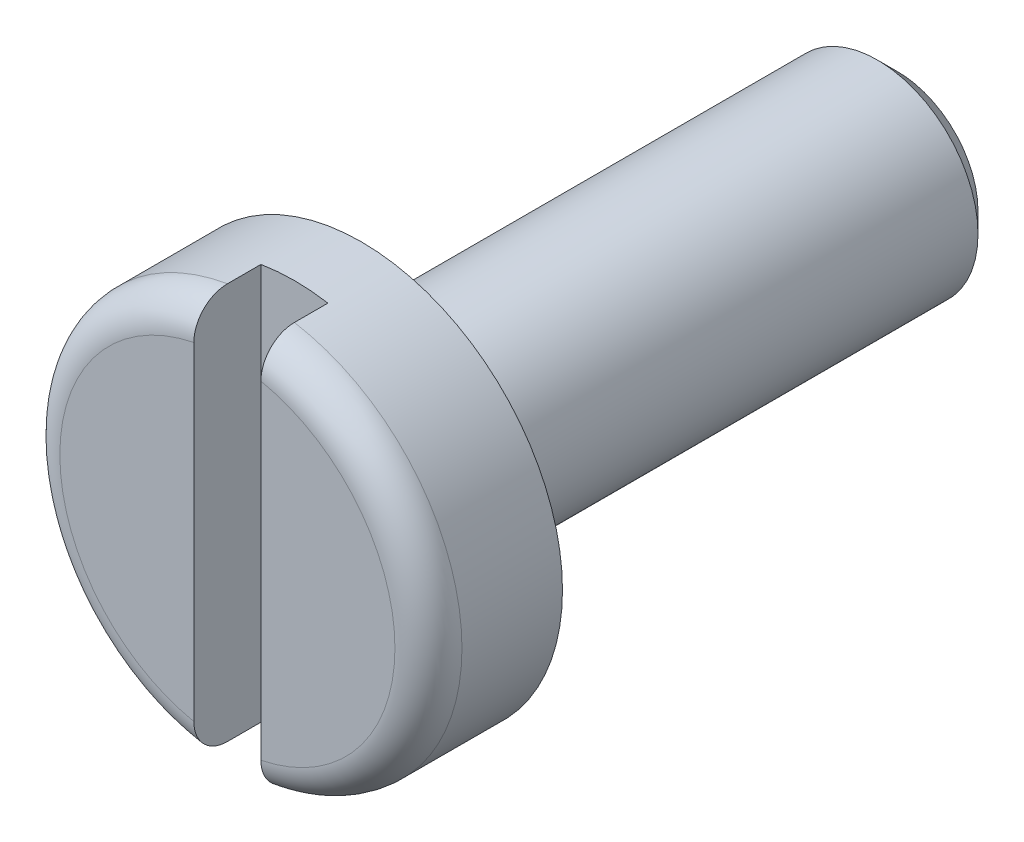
ISO-10303-21;
HEADER;
FILE_DESCRIPTION(('STEP AP214'),'2;1');
FILE_NAME('part.step','',(''),(''),'','','');
FILE_SCHEMA(('AUTOMOTIVE_DESIGN { 1 0 10303 214 1 1 1 1 }'));
ENDSEC;
DATA;
#1=APPLICATION_CONTEXT('core data for automotive mechanical design processes');
#2=APPLICATION_PROTOCOL_DEFINITION('international standard','automotive_design',2000,#1);
#3=PRODUCT_CONTEXT('',#1,'mechanical');
#4=PRODUCT('Part','Part','',(#3));
#5=PRODUCT_RELATED_PRODUCT_CATEGORY('part','',(#4));
#6=PRODUCT_DEFINITION_FORMATION('','',#4);
#7=PRODUCT_DEFINITION_CONTEXT('part definition',#1,'design');
#8=PRODUCT_DEFINITION('design','',#6,#7);
#9=PRODUCT_DEFINITION_SHAPE('','',#8);
#10=(LENGTH_UNIT() NAMED_UNIT(*) SI_UNIT(.MILLI.,.METRE.));
#11=(NAMED_UNIT(*) PLANE_ANGLE_UNIT() SI_UNIT($,.RADIAN.));
#12=(NAMED_UNIT(*) SI_UNIT($,.STERADIAN.) SOLID_ANGLE_UNIT());
#13=UNCERTAINTY_MEASURE_WITH_UNIT(LENGTH_MEASURE(1.E-05),#10,'distance_accuracy_value','');
#14=(GEOMETRIC_REPRESENTATION_CONTEXT(3) GLOBAL_UNCERTAINTY_ASSIGNED_CONTEXT((#13)) GLOBAL_UNIT_ASSIGNED_CONTEXT((#10,
#11,#12)) REPRESENTATION_CONTEXT('',''));
#15=CARTESIAN_POINT('',(0.,0.,0.));
#16=DIRECTION('',(0.,0.,1.));
#17=DIRECTION('',(1.,0.,0.));
#18=AXIS2_PLACEMENT_3D('',#15,#16,#17);
#19=CARTESIAN_POINT('',(0.,0.,10.));
#20=DIRECTION('',(0.,0.,1.));
#21=DIRECTION('',(1.,0.,0.));
#22=AXIS2_PLACEMENT_3D('',#19,#20,#21);
#23=PLANE('',#22);
#24=DIRECTION('',(0.,-1.,0.));
#25=VECTOR('',#24,1.);
#26=CARTESIAN_POINT('',(-0.5,3.22863713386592,10.));
#27=LINE('',#26,#25);
#28=CARTESIAN_POINT('',(-0.5,2.44948974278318,10.));
#29=VERTEX_POINT('',#28);
#30=CARTESIAN_POINT('',(-0.5,-2.44948974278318,10.));
#31=VERTEX_POINT('',#30);
#32=EDGE_CURVE('E100',#29,#31,#27,.T.);
#33=ORIENTED_EDGE('',*,*,#32,.F.);
#34=CARTESIAN_POINT('',(0.,0.,10.));
#35=DIRECTION('',(0.,0.,1.));
#36=DIRECTION('',(1.,0.,0.));
#37=AXIS2_PLACEMENT_3D('',#34,#35,#36);
#38=CIRCLE('',#37,2.5);
#39=EDGE_CURVE('E112',#29,#31,#38,.T.);
#40=ORIENTED_EDGE('',*,*,#39,.T.);
#41=EDGE_LOOP('',(#33,#40));
#42=FACE_BOUND('',#41,.T.);
#43=ADVANCED_FACE('F45',(#42),#23,.T.);
#44=CARTESIAN_POINT('',(0.,0.,9.5));
#45=DIRECTION('',(0.,0.,1.));
#46=DIRECTION('',(1.,0.,0.));
#47=AXIS2_PLACEMENT_3D('',#44,#45,#46);
#48=TOROIDAL_SURFACE('',#47,2.5,0.5);
#49=CARTESIAN_POINT('',(-0.5,-2.95035211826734,9.58673244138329));
#50=CARTESIAN_POINT('',(-0.5,-2.9552262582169,9.55944159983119));
#51=CARTESIAN_POINT('',(-0.5,-2.95779886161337,9.53171948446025));
#52=CARTESIAN_POINT('',(-0.5,-2.9582489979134,9.47621500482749));
#53=CARTESIAN_POINT('',(-0.5,-2.95612106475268,9.44843260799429));
#54=CARTESIAN_POINT('',(-0.5,-2.94723003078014,9.39363370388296));
#55=CARTESIAN_POINT('',(-0.5,-2.94046955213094,9.36661677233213));
#56=CARTESIAN_POINT('',(-0.5,-2.92252194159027,9.31410440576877));
#57=CARTESIAN_POINT('',(-0.5,-2.91133582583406,9.28860862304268));
#58=CARTESIAN_POINT('',(-0.5,-2.88483470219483,9.23977125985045));
#59=CARTESIAN_POINT('',(-0.5,-2.86950835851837,9.21643583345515));
#60=CARTESIAN_POINT('',(-0.5,-2.83519284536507,9.17263473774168));
#61=CARTESIAN_POINT('',(-0.5,-2.81620340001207,9.15216928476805));
#62=CARTESIAN_POINT('',(-0.5,-2.77489524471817,9.11445400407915));
#63=CARTESIAN_POINT('',(-0.5,-2.75254376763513,9.09724007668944));
#64=CARTESIAN_POINT('',(-0.5,-2.70530445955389,9.06674270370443));
#65=CARTESIAN_POINT('',(-0.5,-2.68041644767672,9.05345953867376));
#66=CARTESIAN_POINT('',(-0.5,-2.62840350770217,9.0309805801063));
#67=CARTESIAN_POINT('',(-0.5,-2.60125007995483,9.02185074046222));
#68=CARTESIAN_POINT('',(-0.5,-2.54580904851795,9.00819871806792));
#69=CARTESIAN_POINT('',(-0.5,-2.51752134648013,9.00367693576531));
#70=CARTESIAN_POINT('',(-0.5,-2.46012662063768,8.99929986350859));
#71=CARTESIAN_POINT('',(-0.5,-2.4310137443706,8.99952119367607));
#72=CARTESIAN_POINT('',(-0.5,-2.37322772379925,9.00479285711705));
#73=CARTESIAN_POINT('',(-0.5,-2.34455461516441,9.00984358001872));
#74=CARTESIAN_POINT('',(-0.5,-2.28814273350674,9.02471030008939));
#75=CARTESIAN_POINT('',(-0.5,-2.26041717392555,9.0345765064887));
#76=CARTESIAN_POINT('',(-0.5,-2.20701871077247,9.05883277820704));
#77=CARTESIAN_POINT('',(-0.5,-2.18134585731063,9.07322295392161));
#78=CARTESIAN_POINT('',(-0.5,-2.13286586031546,9.10611125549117));
#79=CARTESIAN_POINT('',(-0.5,-2.11005221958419,9.12459979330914));
#80=CARTESIAN_POINT('',(-0.5,-2.06792695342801,9.1652124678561));
#81=CARTESIAN_POINT('',(-0.5,-2.04861500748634,9.1873362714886));
#82=CARTESIAN_POINT('',(-0.5,-2.01446117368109,9.23415097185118));
#83=CARTESIAN_POINT('',(-0.5,-1.9995404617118,9.25878431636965));
#84=CARTESIAN_POINT('',(-0.5,-1.97419007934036,9.31026302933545));
#85=CARTESIAN_POINT('',(-0.5,-1.96375954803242,9.33710797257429));
#86=CARTESIAN_POINT('',(-0.5,-1.94799923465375,9.39141122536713));
#87=CARTESIAN_POINT('',(-0.5,-1.94253032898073,9.41882918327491));
#88=CARTESIAN_POINT('',(-0.5,-1.93637923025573,9.47419566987));
#89=CARTESIAN_POINT('',(-0.5,-1.93569635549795,9.50214412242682));
#90=CARTESIAN_POINT('',(-0.5,-1.93910574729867,9.55717926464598));
#91=CARTESIAN_POINT('',(-0.5,-1.94310200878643,9.58427196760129));
#92=CARTESIAN_POINT('',(-0.5,-1.95557178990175,9.63740480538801));
#93=CARTESIAN_POINT('',(-0.5,-1.96404530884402,9.66344494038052));
#94=CARTESIAN_POINT('',(-0.5,-1.98522261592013,9.71385005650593));
#95=CARTESIAN_POINT('',(-0.5,-1.9979413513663,9.73820874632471));
#96=CARTESIAN_POINT('',(-0.5,-2.02719570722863,9.78451298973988));
#97=CARTESIAN_POINT('',(-0.5,-2.04373174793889,9.80645827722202));
#98=CARTESIAN_POINT('',(-0.5,-2.08056612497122,9.84788184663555));
#99=CARTESIAN_POINT('',(-0.5,-2.10094523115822,9.86728828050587));
#100=CARTESIAN_POINT('',(-0.5,-2.14459530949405,9.90251725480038));
#101=CARTESIAN_POINT('',(-0.5,-2.1678666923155,9.91833928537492));
#102=CARTESIAN_POINT('',(-0.5,-2.21733710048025,9.94640011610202));
#103=CARTESIAN_POINT('',(-0.5,-2.24359938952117,9.95852745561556));
#104=CARTESIAN_POINT('',(-0.5,-2.2977657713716,9.97828239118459));
#105=CARTESIAN_POINT('',(-0.5,-2.32567003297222,9.9859095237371));
#106=CARTESIAN_POINT('',(-0.5,-2.38281564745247,9.99654662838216));
#107=CARTESIAN_POINT('',(-0.5,-2.41207134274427,9.99947974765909));
#108=CARTESIAN_POINT('',(-0.5,-2.47066120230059,10.0003935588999));
#109=CARTESIAN_POINT('',(-0.5,-2.49999536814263,9.99837415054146));
#110=CARTESIAN_POINT('',(-0.5,-2.55790116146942,9.98941380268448));
#111=CARTESIAN_POINT('',(-0.5,-2.58647286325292,9.98247334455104));
#112=CARTESIAN_POINT('',(-0.5,-2.64202024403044,9.96383545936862));
#113=CARTESIAN_POINT('',(-0.5,-2.66899607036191,9.9521384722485));
#114=CARTESIAN_POINT('',(-0.5,-2.72022813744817,9.92446321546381));
#115=CARTESIAN_POINT('',(-0.5,-2.744513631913,9.90853911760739));
#116=CARTESIAN_POINT('',(-0.5,-2.79001381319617,9.87277033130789));
#117=CARTESIAN_POINT('',(-0.5,-2.81122799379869,9.85292499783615));
#118=CARTESIAN_POINT('',(-0.5,-2.8496084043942,9.81022796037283));
#119=CARTESIAN_POINT('',(-0.5,-2.86683447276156,9.78742998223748));
#120=CARTESIAN_POINT('',(-0.5,-2.89712793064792,9.7392475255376));
#121=CARTESIAN_POINT('',(-0.5,-2.91020078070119,9.71386650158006));
#122=CARTESIAN_POINT('',(-0.5,-2.92766179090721,9.67134620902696));
#123=CARTESIAN_POINT('',(-0.5,-2.93345883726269,9.65477098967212));
#124=CARTESIAN_POINT('',(-0.5,-2.94326182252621,9.62109888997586));
#125=CARTESIAN_POINT('',(-0.5,-2.9472677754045,9.6040020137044));
#126=CARTESIAN_POINT('',(-0.5,-2.95035211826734,9.58673244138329));
#127=B_SPLINE_CURVE_WITH_KNOTS('',3,(#49,#50,#51,#52,#53,#54,#55,#56,#57,#58,#59,#60,#61,#62,
#63,#64,#65,#66,#67,#68,#69,#70,#71,#72,#73,#74,#75,#76,#77,#78,#79,#80,#81,#82,#83,#84,#85,#86,
#87,#88,#89,#90,#91,#92,#93,#94,#95,#96,#97,#98,#99,#100,#101,#102,#103,#104,#105,#106,#107,
#108,#109,#110,#111,#112,#113,#114,#115,#116,#117,#118,#119,#120,#121,#122,#123,#124,#125,#126),
.UNSPECIFIED.,.T.,.F.,(4,2,2,2,2,2,2,2,2,2,2,2,2,2,2,2,2,2,2,2,2,2,2,2,2,2,2,2,2,2,2,2,2,2,2,2,
2,2,4),(0.,0.0831039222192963,0.166304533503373,0.249458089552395,0.3325925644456,
0.415957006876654,0.499327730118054,0.583571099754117,0.667820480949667,0.753364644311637,
0.838916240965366,0.925850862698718,1.01279249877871,1.10066065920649,1.18853096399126,
1.27619782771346,1.36385666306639,1.44982967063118,1.53578618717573,1.61925046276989,
1.70270284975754,1.78447255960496,1.86624225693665,1.94830295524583,2.03037269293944,
2.11441209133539,2.19846343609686,2.2848442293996,2.37123391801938,2.4590240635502,
2.54681598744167,2.63459932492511,2.72237454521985,2.80907507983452,2.89578988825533,
2.98110432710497,3.06630612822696,3.11889448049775,3.1714824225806),.UNSPECIFIED.);
#128=CARTESIAN_POINT('',(-0.5,-2.95803989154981,9.5));
#129=VERTEX_POINT('',#128);
#130=EDGE_CURVE('E69',#31,#129,#127,.T.);
#131=ORIENTED_EDGE('',*,*,#130,.F.);
#132=ORIENTED_EDGE('',*,*,#39,.F.);
#133=CARTESIAN_POINT('',(-0.5,1.94578845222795,9.59445559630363));
#134=CARTESIAN_POINT('',(-0.5,1.94047373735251,9.56769133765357));
#135=CARTESIAN_POINT('',(-0.5,1.93741427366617,9.54046015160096));
#136=CARTESIAN_POINT('',(-0.5,1.93592664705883,9.4858519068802));
#137=CARTESIAN_POINT('',(-0.5,1.93750333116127,9.4584747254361));
#138=CARTESIAN_POINT('',(-0.5,1.94523620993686,9.40439385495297));
#139=CARTESIAN_POINT('',(-0.5,1.95138916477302,9.37768970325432));
#140=CARTESIAN_POINT('',(-0.5,1.96805796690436,9.32568825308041));
#141=CARTESIAN_POINT('',(-0.5,1.97857312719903,9.30039073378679));
#142=CARTESIAN_POINT('',(-0.5,2.00371458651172,9.25169307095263));
#143=CARTESIAN_POINT('',(-0.5,2.01837080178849,9.2283083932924));
#144=CARTESIAN_POINT('',(-0.5,2.05130528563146,9.18424726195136));
#145=CARTESIAN_POINT('',(-0.5,2.06958408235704,9.16357120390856));
#146=CARTESIAN_POINT('',(-0.5,2.1097606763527,9.12492661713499));
#147=CARTESIAN_POINT('',(-0.5,2.13174179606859,9.10704472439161));
#148=CARTESIAN_POINT('',(-0.5,2.1783299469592,9.07511229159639));
#149=CARTESIAN_POINT('',(-0.5,2.20293734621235,9.0610622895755));
#150=CARTESIAN_POINT('',(-0.5,2.25477190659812,9.03682556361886));
#151=CARTESIAN_POINT('',(-0.5,2.28205058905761,9.02674892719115));
#152=CARTESIAN_POINT('',(-0.5,2.3379011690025,9.01125429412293));
#153=CARTESIAN_POINT('',(-0.5,2.36647317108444,9.00583667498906));
#154=CARTESIAN_POINT('',(-0.5,2.42447780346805,8.99977564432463));
#155=CARTESIAN_POINT('',(-0.5,2.45391670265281,8.99919195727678));
#156=CARTESIAN_POINT('',(-0.5,2.51247328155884,9.00299281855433));
#157=CARTESIAN_POINT('',(-0.5,2.54159096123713,9.00737736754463));
#158=CARTESIAN_POINT('',(-0.5,2.59856027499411,9.02099630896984));
#159=CARTESIAN_POINT('',(-0.5,2.6264160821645,9.03021321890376));
#160=CARTESIAN_POINT('',(-0.5,2.6801515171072,9.05325789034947));
#161=CARTESIAN_POINT('',(-0.5,2.70603127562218,9.0670853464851));
#162=CARTESIAN_POINT('',(-0.5,2.75469065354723,9.09875942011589));
#163=CARTESIAN_POINT('',(-0.5,2.77750835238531,9.11654752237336));
#164=CARTESIAN_POINT('',(-0.5,2.8197692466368,9.15576145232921));
#165=CARTESIAN_POINT('',(-0.5,2.83921274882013,9.17718694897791));
#166=CARTESIAN_POINT('',(-0.5,2.87383046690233,9.2226821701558));
#167=CARTESIAN_POINT('',(-0.5,2.8890704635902,9.24670184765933));
#168=CARTESIAN_POINT('',(-0.5,2.91523641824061,9.29698624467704));
#169=CARTESIAN_POINT('',(-0.5,2.9261627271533,9.32325078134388));
#170=CARTESIAN_POINT('',(-0.5,2.94324351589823,9.37689257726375));
#171=CARTESIAN_POINT('',(-0.5,2.94946107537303,9.40424976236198));
#172=CARTESIAN_POINT('',(-0.5,2.95717759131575,9.45962138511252));
#173=CARTESIAN_POINT('',(-0.5,2.95867678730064,9.48763578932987));
#174=CARTESIAN_POINT('',(-0.5,2.95691729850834,9.54330961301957));
#175=CARTESIAN_POINT('',(-0.5,2.9536931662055,9.57097013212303));
#176=CARTESIAN_POINT('',(-0.5,2.94264811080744,9.62535688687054));
#177=CARTESIAN_POINT('',(-0.5,2.93482724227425,9.65208313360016));
#178=CARTESIAN_POINT('',(-0.5,2.91482050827,9.70386040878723));
#179=CARTESIAN_POINT('',(-0.5,2.90263280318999,9.7289107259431));
#180=CARTESIAN_POINT('',(-0.5,2.87425638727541,9.77663106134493));
#181=CARTESIAN_POINT('',(-0.5,2.85806756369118,9.79930101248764));
#182=CARTESIAN_POINT('',(-0.5,2.82201972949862,9.84181694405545));
#183=CARTESIAN_POINT('',(-0.5,2.80213259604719,9.86163907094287));
#184=CARTESIAN_POINT('',(-0.5,2.75935276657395,9.89771791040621));
#185=CARTESIAN_POINT('',(-0.5,2.73645988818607,9.91397440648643));
#186=CARTESIAN_POINT('',(-0.5,2.68798257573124,9.94270597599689));
#187=CARTESIAN_POINT('',(-0.5,2.66236522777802,9.9551255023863));
#188=CARTESIAN_POINT('',(-0.5,2.6094327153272,9.97556637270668));
#189=CARTESIAN_POINT('',(-0.5,2.58211740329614,9.98358733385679));
#190=CARTESIAN_POINT('',(-0.5,2.52608361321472,9.99514067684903));
#191=CARTESIAN_POINT('',(-0.5,2.49734942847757,9.99859689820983));
#192=CARTESIAN_POINT('',(-0.5,2.43970498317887,10.0007067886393));
#193=CARTESIAN_POINT('',(-0.5,2.41079470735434,9.99936003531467));
#194=CARTESIAN_POINT('',(-0.5,2.3532003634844,9.9918654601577));
#195=CARTESIAN_POINT('',(-0.5,2.32452477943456,9.98565230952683));
#196=CARTESIAN_POINT('',(-0.5,2.26861556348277,9.96851868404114));
#197=CARTESIAN_POINT('',(-0.5,2.24138195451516,9.95759813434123));
#198=CARTESIAN_POINT('',(-0.5,2.18904591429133,9.93129320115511));
#199=CARTESIAN_POINT('',(-0.5,2.16395095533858,9.91589393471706));
#200=CARTESIAN_POINT('',(-0.5,2.11673735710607,9.88104524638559));
#201=CARTESIAN_POINT('',(-0.5,2.09461934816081,9.8615949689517));
#202=CARTESIAN_POINT('',(-0.5,2.05431518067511,9.8194369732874));
#203=CARTESIAN_POINT('',(-0.5,2.03608387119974,9.79677241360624));
#204=CARTESIAN_POINT('',(-0.5,2.00383030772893,9.74865099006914));
#205=CARTESIAN_POINT('',(-0.5,1.98980208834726,9.72319815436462));
#206=CARTESIAN_POINT('',(-0.5,1.97088028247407,9.68034156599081));
#207=CARTESIAN_POINT('',(-0.5,1.96454207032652,9.66356088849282));
#208=CARTESIAN_POINT('',(-0.5,1.95374122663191,9.62940578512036));
#209=CARTESIAN_POINT('',(-0.5,1.94927856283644,9.61203136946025));
#210=CARTESIAN_POINT('',(-0.5,1.94578845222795,9.59445559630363));
#211=B_SPLINE_CURVE_WITH_KNOTS('',3,(#133,#134,#135,#136,#137,#138,#139,#140,#141,#142,#143,
#144,#145,#146,#147,#148,#149,#150,#151,#152,#153,#154,#155,#156,#157,#158,#159,#160,#161,#162,
#163,#164,#165,#166,#167,#168,#169,#170,#171,#172,#173,#174,#175,#176,#177,#178,#179,#180,#181,
#182,#183,#184,#185,#186,#187,#188,#189,#190,#191,#192,#193,#194,#195,#196,#197,#198,#199,#200,
#201,#202,#203,#204,#205,#206,#207,#208,#209,#210),.UNSPECIFIED.,.T.,.F.,(4,2,2,2,2,2,2,2,2,2,2,
2,2,2,2,2,2,2,2,2,2,2,2,2,2,2,2,2,2,2,2,2,2,2,2,2,2,2,4),(0.,0.0817950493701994,
0.163675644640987,0.245498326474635,0.327308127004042,0.40972476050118,0.492153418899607,
0.57677437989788,0.661407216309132,0.748243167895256,0.835086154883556,0.92300053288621,
1.0109149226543,1.09851342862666,1.18610613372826,1.27248175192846,1.3588495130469,
1.44377716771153,1.52869791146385,1.61245986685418,1.69621757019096,1.77936561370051,
1.86251267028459,1.94569479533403,2.02887926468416,2.11272427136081,2.19657436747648,
2.28158689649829,2.3666068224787,2.45302806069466,2.5394568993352,2.6270663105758,
2.71467711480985,2.80258244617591,2.89050636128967,2.97734529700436,3.06406039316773,
3.11777516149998,3.17148900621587),.UNSPECIFIED.);
#212=CARTESIAN_POINT('',(-0.5,2.95803989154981,9.5));
#213=VERTEX_POINT('',#212);
#214=EDGE_CURVE('E96',#213,#29,#211,.T.);
#215=ORIENTED_EDGE('',*,*,#214,.F.);
#216=CARTESIAN_POINT('',(0.,0.,9.5));
#217=DIRECTION('',(0.,0.,1.));
#218=DIRECTION('',(1.,0.,0.));
#219=AXIS2_PLACEMENT_3D('',#216,#217,#218);
#220=CIRCLE('',#219,3.);
#221=EDGE_CURVE('E123',#129,#213,#220,.F.);
#222=ORIENTED_EDGE('',*,*,#221,.F.);
#223=EDGE_LOOP('',(#131,#132,#215,#222));
#224=FACE_BOUND('',#223,.T.);
#225=ADVANCED_FACE('F115',(#224),#48,.T.);
#226=CARTESIAN_POINT('',(0.,0.,8.));
#227=DIRECTION('',(0.,0.,-1.));
#228=DIRECTION('',(-1.,0.,0.));
#229=AXIS2_PLACEMENT_3D('',#226,#227,#228);
#230=CYLINDRICAL_SURFACE('',#229,1.5);
#231=CARTESIAN_POINT('',(0.,0.,0.300000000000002));
#232=DIRECTION('',(0.,0.,1.));
#233=DIRECTION('',(1.,0.,0.));
#234=AXIS2_PLACEMENT_3D('',#231,#232,#233);
#235=CIRCLE('',#234,1.5);
#236=CARTESIAN_POINT('',(1.5,0.,0.300000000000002));
#237=VERTEX_POINT('',#236);
#238=EDGE_CURVE('E130',#237,#237,#235,.T.);
#239=ORIENTED_EDGE('',*,*,#238,.T.);
#240=EDGE_LOOP('',(#239));
#241=FACE_BOUND('',#240,.T.);
#242=CARTESIAN_POINT('',(0.,0.,8.));
#243=DIRECTION('',(0.,0.,1.));
#244=DIRECTION('',(1.,0.,0.));
#245=AXIS2_PLACEMENT_3D('',#242,#243,#244);
#246=CIRCLE('',#245,1.5);
#247=CARTESIAN_POINT('',(1.5,0.,8.));
#248=VERTEX_POINT('',#247);
#249=EDGE_CURVE('E126',#248,#248,#246,.T.);
#250=ORIENTED_EDGE('',*,*,#249,.F.);
#251=EDGE_LOOP('',(#250));
#252=FACE_BOUND('',#251,.T.);
#253=ADVANCED_FACE('F211',(#241,#252),#230,.T.);
#254=CARTESIAN_POINT('',(0.,0.,0.));
#255=DIRECTION('',(0.,0.,1.));
#256=DIRECTION('',(1.,0.,0.));
#257=AXIS2_PLACEMENT_3D('',#254,#255,#256);
#258=PLANE('',#257);
#259=CARTESIAN_POINT('',(0.,0.,0.));
#260=DIRECTION('',(0.,0.,1.));
#261=DIRECTION('',(1.,0.,0.));
#262=AXIS2_PLACEMENT_3D('',#259,#260,#261);
#263=CIRCLE('',#262,1.2);
#264=CARTESIAN_POINT('',(1.2,0.,0.));
#265=VERTEX_POINT('',#264);
#266=EDGE_CURVE('E134',#265,#265,#263,.F.);
#267=ORIENTED_EDGE('',*,*,#266,.T.);
#268=EDGE_LOOP('',(#267));
#269=FACE_BOUND('',#268,.T.);
#270=ADVANCED_FACE('F213',(#269),#258,.F.);
#271=CARTESIAN_POINT('',(0.,0.,8.));
#272=DIRECTION('',(0.,0.,1.));
#273=DIRECTION('',(1.,0.,0.));
#274=AXIS2_PLACEMENT_3D('',#271,#272,#273);
#275=PLANE('',#274);
#276=CARTESIAN_POINT('',(0.,0.,8.));
#277=DIRECTION('',(0.,0.,1.));
#278=DIRECTION('',(1.,0.,0.));
#279=AXIS2_PLACEMENT_3D('',#276,#277,#278);
#280=CIRCLE('',#279,3.);
#281=CARTESIAN_POINT('',(3.,0.,8.));
#282=VERTEX_POINT('',#281);
#283=EDGE_CURVE('E201',#282,#282,#280,.T.);
#284=ORIENTED_EDGE('',*,*,#283,.F.);
#285=EDGE_LOOP('',(#284));
#286=FACE_BOUND('',#285,.T.);
#287=ORIENTED_EDGE('',*,*,#249,.T.);
#288=EDGE_LOOP('',(#287));
#289=FACE_BOUND('',#288,.T.);
#290=ADVANCED_FACE('F209',(#286,#289),#275,.F.);
#291=CARTESIAN_POINT('',(0.,0.,10.));
#292=DIRECTION('',(0.,0.,-1.));
#293=DIRECTION('',(-1.,0.,0.));
#294=AXIS2_PLACEMENT_3D('',#291,#292,#293);
#295=CYLINDRICAL_SURFACE('',#294,3.);
#296=ORIENTED_EDGE('',*,*,#221,.T.);
#297=DIRECTION('',(0.,0.,-1.));
#298=VECTOR('',#297,1.);
#299=CARTESIAN_POINT('',(-0.5,2.95803989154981,10.));
#300=LINE('',#299,#298);
#301=CARTESIAN_POINT('',(-0.5,2.95803989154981,9.));
#302=VERTEX_POINT('',#301);
#303=EDGE_CURVE('E102',#213,#302,#300,.T.);
#304=ORIENTED_EDGE('',*,*,#303,.T.);
#305=CARTESIAN_POINT('',(0.,0.,9.));
#306=DIRECTION('',(0.,0.,1.));
#307=DIRECTION('',(1.,0.,0.));
#308=AXIS2_PLACEMENT_3D('',#305,#306,#307);
#309=CIRCLE('',#308,3.);
#310=CARTESIAN_POINT('',(0.5,2.95803989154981,9.));
#311=VERTEX_POINT('',#310);
#312=EDGE_CURVE('E11',#311,#302,#309,.T.);
#313=ORIENTED_EDGE('',*,*,#312,.F.);
#314=DIRECTION('',(0.,0.,-1.));
#315=VECTOR('',#314,1.);
#316=CARTESIAN_POINT('',(0.5,2.95803989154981,10.));
#317=LINE('',#316,#315);
#318=CARTESIAN_POINT('',(0.5,2.95803989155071,9.49999999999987));
#319=VERTEX_POINT('',#318);
#320=EDGE_CURVE('E185',#311,#319,#317,.F.);
#321=ORIENTED_EDGE('',*,*,#320,.T.);
#322=CARTESIAN_POINT('',(0.5,-2.95803989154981,9.5));
#323=VERTEX_POINT('',#322);
#324=EDGE_CURVE('E117',#319,#323,#220,.F.);
#325=ORIENTED_EDGE('',*,*,#324,.T.);
#326=DIRECTION('',(0.,0.,-1.));
#327=VECTOR('',#326,1.);
#328=CARTESIAN_POINT('',(0.5,-2.95803989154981,10.));
#329=LINE('',#328,#327);
#330=CARTESIAN_POINT('',(0.5,-2.95803989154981,9.));
#331=VERTEX_POINT('',#330);
#332=EDGE_CURVE('E182',#323,#331,#329,.T.);
#333=ORIENTED_EDGE('',*,*,#332,.T.);
#334=CARTESIAN_POINT('',(-0.5,-2.95803989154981,9.));
#335=VERTEX_POINT('',#334);
#336=EDGE_CURVE('E49',#335,#331,#309,.T.);
#337=ORIENTED_EDGE('',*,*,#336,.F.);
#338=DIRECTION('',(0.,0.,-1.));
#339=VECTOR('',#338,1.);
#340=CARTESIAN_POINT('',(-0.5,-2.95803989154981,10.));
#341=LINE('',#340,#339);
#342=EDGE_CURVE('E195',#335,#129,#341,.F.);
#343=ORIENTED_EDGE('',*,*,#342,.T.);
#344=EDGE_LOOP('',(#296,#304,#313,#321,#325,#333,#337,#343));
#345=FACE_BOUND('',#344,.T.);
#346=ORIENTED_EDGE('',*,*,#283,.T.);
#347=EDGE_LOOP('',(#346));
#348=FACE_BOUND('',#347,.T.);
#349=ADVANCED_FACE('F188',(#345,#348),#295,.T.);
#350=DIRECTION('',(0.,1.,0.));
#351=VECTOR('',#350,1.);
#352=CARTESIAN_POINT('',(0.5,3.22863713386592,10.));
#353=LINE('',#352,#351);
#354=CARTESIAN_POINT('',(0.5,-2.44948974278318,10.));
#355=VERTEX_POINT('',#354);
#356=CARTESIAN_POINT('',(0.5,2.44948974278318,10.));
#357=VERTEX_POINT('',#356);
#358=EDGE_CURVE('E61',#355,#357,#353,.T.);
#359=ORIENTED_EDGE('',*,*,#358,.F.);
#360=EDGE_CURVE('E118',#355,#357,#38,.T.);
#361=ORIENTED_EDGE('',*,*,#360,.T.);
#362=EDGE_LOOP('',(#359,#361));
#363=FACE_BOUND('',#362,.T.);
#364=ADVANCED_FACE('F161',(#363),#23,.T.);
#365=CARTESIAN_POINT('',(0.5,-2.95035211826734,9.58673244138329));
#366=CARTESIAN_POINT('',(0.5,-2.9454456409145,9.61418966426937));
#367=CARTESIAN_POINT('',(0.5,-2.93820205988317,9.64125077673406));
#368=CARTESIAN_POINT('',(0.5,-2.9192538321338,9.69378868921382));
#369=CARTESIAN_POINT('',(0.5,-2.90754355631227,9.71926344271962));
#370=CARTESIAN_POINT('',(0.5,-2.88002854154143,9.76786782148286));
#371=CARTESIAN_POINT('',(0.5,-2.86422747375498,9.79099952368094));
#372=CARTESIAN_POINT('',(0.5,-2.82899978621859,9.83430132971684));
#373=CARTESIAN_POINT('',(0.5,-2.8095740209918,9.85447212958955));
#374=CARTESIAN_POINT('',(0.5,-2.76748678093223,9.891475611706));
#375=CARTESIAN_POINT('',(0.5,-2.74480029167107,9.90827983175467));
#376=CARTESIAN_POINT('',(0.5,-2.69696279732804,9.93790959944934));
#377=CARTESIAN_POINT('',(0.5,-2.67181152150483,9.950734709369));
#378=CARTESIAN_POINT('',(0.5,-2.61934293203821,9.97225590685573));
#379=CARTESIAN_POINT('',(0.5,-2.59199802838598,9.98088472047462));
#380=CARTESIAN_POINT('',(0.5,-2.53625922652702,9.99350944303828));
#381=CARTESIAN_POINT('',(0.5,-2.50786523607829,9.99750494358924));
#382=CARTESIAN_POINT('',(0.5,-2.45034814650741,10.0008087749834));
#383=CARTESIAN_POINT('',(0.5,-2.42122065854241,10.0000408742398));
#384=CARTESIAN_POINT('',(0.5,-2.36349686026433,9.99367859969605));
#385=CARTESIAN_POINT('',(0.5,-2.33490059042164,9.9880838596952));
#386=CARTESIAN_POINT('',(0.5,-2.27874941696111,9.97214341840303));
#387=CARTESIAN_POINT('',(0.5,-2.25120798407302,9.96175020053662));
#388=CARTESIAN_POINT('',(0.5,-2.19826616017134,9.9364741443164));
#389=CARTESIAN_POINT('',(0.5,-2.17286581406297,9.9215912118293));
#390=CARTESIAN_POINT('',(0.5,-2.1250364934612,9.88778165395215));
#391=CARTESIAN_POINT('',(0.5,-2.10259817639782,9.86886825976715));
#392=CARTESIAN_POINT('',(0.5,-2.0612946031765,9.82747331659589));
#393=CARTESIAN_POINT('',(0.5,-2.04242899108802,9.80499212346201));
#394=CARTESIAN_POINT('',(0.5,-2.00923378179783,9.75756986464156));
#395=CARTESIAN_POINT('',(0.5,-1.99482061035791,9.73268734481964));
#396=CARTESIAN_POINT('',(0.5,-1.97052130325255,9.68080186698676));
#397=CARTESIAN_POINT('',(0.5,-1.96063429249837,9.65379932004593));
#398=CARTESIAN_POINT('',(0.5,-1.94596278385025,9.59928379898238));
#399=CARTESIAN_POINT('',(0.5,-1.94103840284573,9.57180843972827));
#400=CARTESIAN_POINT('',(0.5,-1.93597258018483,9.51642154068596));
#401=CARTESIAN_POINT('',(0.5,-1.93583049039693,9.48851006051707));
#402=CARTESIAN_POINT('',(0.5,-1.94028963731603,9.43360827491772));
#403=CARTESIAN_POINT('',(0.5,-1.94480037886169,9.40661055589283));
#404=CARTESIAN_POINT('',(0.5,-1.95826932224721,9.35375014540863));
#405=CARTESIAN_POINT('',(0.5,-1.9672275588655,9.32788746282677));
#406=CARTESIAN_POINT('',(0.5,-1.98934771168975,9.27787586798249));
#407=CARTESIAN_POINT('',(0.5,-2.00253035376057,9.25373613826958));
#408=CARTESIAN_POINT('',(0.5,-2.03266769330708,9.20794068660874));
#409=CARTESIAN_POINT('',(0.5,-2.0496228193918,9.18628524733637));
#410=CARTESIAN_POINT('',(0.5,-2.08726367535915,9.14549636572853));
#411=CARTESIAN_POINT('',(0.5,-2.10803122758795,9.12643845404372));
#412=CARTESIAN_POINT('',(0.5,-2.15239703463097,9.09196636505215));
#413=CARTESIAN_POINT('',(0.5,-2.17599569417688,9.07655270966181));
#414=CARTESIAN_POINT('',(0.5,-2.22605207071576,9.04937556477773));
#415=CARTESIAN_POINT('',(0.5,-2.25257040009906,9.03772363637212));
#416=CARTESIAN_POINT('',(0.5,-2.30716797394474,9.01895966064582));
#417=CARTESIAN_POINT('',(0.5,-2.33524736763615,9.01184804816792));
#418=CARTESIAN_POINT('',(0.5,-2.39263302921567,9.00228335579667));
#419=CARTESIAN_POINT('',(0.5,-2.42195149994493,8.99990327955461));
#420=CARTESIAN_POINT('',(0.5,-2.48057282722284,9.00010275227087));
#421=CARTESIAN_POINT('',(0.5,-2.5098756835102,9.00268238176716));
#422=CARTESIAN_POINT('',(0.5,-2.56759806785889,9.01275115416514));
#423=CARTESIAN_POINT('',(0.5,-2.59601842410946,9.02023553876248));
#424=CARTESIAN_POINT('',(0.5,-2.6511729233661,9.03993013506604));
#425=CARTESIAN_POINT('',(0.5,-2.67790715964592,9.05214008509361));
#426=CARTESIAN_POINT('',(0.5,-2.72856509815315,9.08078406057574));
#427=CARTESIAN_POINT('',(0.5,-2.75251991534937,9.09716303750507));
#428=CARTESIAN_POINT('',(0.5,-2.79727829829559,9.13377309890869));
#429=CARTESIAN_POINT('',(0.5,-2.81808227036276,9.15400368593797));
#430=CARTESIAN_POINT('',(0.5,-2.85557875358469,9.19737748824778));
#431=CARTESIAN_POINT('',(0.5,-2.87233439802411,9.22046613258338));
#432=CARTESIAN_POINT('',(0.5,-2.9016683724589,9.26916909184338));
#433=CARTESIAN_POINT('',(0.5,-2.91424598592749,9.29478383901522));
#434=CARTESIAN_POINT('',(0.5,-2.93468161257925,9.34741429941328));
#435=CARTESIAN_POINT('',(0.5,-2.94260335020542,9.37440532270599));
#436=CARTESIAN_POINT('',(0.5,-2.95374783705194,9.42931645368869));
#437=CARTESIAN_POINT('',(0.5,-2.95697668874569,9.45723530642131));
#438=CARTESIAN_POINT('',(0.5,-2.9583289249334,9.5021991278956));
#439=CARTESIAN_POINT('',(0.5,-2.95795841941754,9.51921257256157));
#440=CARTESIAN_POINT('',(0.5,-2.95546545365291,9.55311055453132));
#441=CARTESIAN_POINT('',(0.5,-2.95334300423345,9.56999509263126));
#442=CARTESIAN_POINT('',(0.5,-2.95035211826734,9.58673244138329));
#443=B_SPLINE_CURVE_WITH_KNOTS('',3,(#365,#366,#367,#368,#369,#370,#371,#372,#373,#374,#375,
#376,#377,#378,#379,#380,#381,#382,#383,#384,#385,#386,#387,#388,#389,#390,#391,#392,#393,#394,
#395,#396,#397,#398,#399,#400,#401,#402,#403,#404,#405,#406,#407,#408,#409,#410,#411,#412,#413,
#414,#415,#416,#417,#418,#419,#420,#421,#422,#423,#424,#425,#426,#427,#428,#429,#430,#431,#432,
#433,#434,#435,#436,#437,#438,#439,#440,#441,#442),.UNSPECIFIED.,.T.,.F.,(4,2,2,2,2,2,2,2,2,2,2,
2,2,2,2,2,2,2,2,2,2,2,2,2,2,2,2,2,2,2,2,2,2,2,2,2,2,2,4),(0.,0.0836137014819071,
0.167333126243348,0.25097767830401,0.334602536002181,0.418907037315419,0.503220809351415,
0.588845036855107,0.674476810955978,0.76148249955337,0.848494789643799,0.936387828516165,
1.02428271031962,1.1118933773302,1.19949531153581,1.28533593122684,1.37115994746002,
1.45449079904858,1.53781035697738,1.61953940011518,1.70126908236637,1.78340605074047,
1.86555235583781,1.94972825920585,2.0339162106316,2.12041043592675,2.20691294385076,
2.29474006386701,2.38256861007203,2.4703120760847,2.55805068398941,2.64468597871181,
2.73131009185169,2.81648063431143,2.90166577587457,2.98565607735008,3.06953706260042,
3.12050654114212,3.17147570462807),.UNSPECIFIED.);
#444=EDGE_CURVE('E108',#323,#355,#443,.T.);
#445=ORIENTED_EDGE('',*,*,#444,.F.);
#446=ORIENTED_EDGE('',*,*,#324,.F.);
#447=CARTESIAN_POINT('',(0.5,1.94578845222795,9.59445559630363));
#448=CARTESIAN_POINT('',(0.5,1.95120964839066,9.62174175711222));
#449=CARTESIAN_POINT('',(0.5,1.95898345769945,9.64858342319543));
#450=CARTESIAN_POINT('',(0.5,1.97897078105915,9.70058566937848));
#451=CARTESIAN_POINT('',(0.5,1.99119053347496,9.72574382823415));
#452=CARTESIAN_POINT('',(0.5,2.01963736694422,9.77362599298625));
#453=CARTESIAN_POINT('',(0.5,2.0358579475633,9.7963538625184));
#454=CARTESIAN_POINT('',(0.5,2.0718067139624,9.83882671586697));
#455=CARTESIAN_POINT('',(0.5,2.09153418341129,9.85857230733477));
#456=CARTESIAN_POINT('',(0.5,2.13436259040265,9.89497258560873));
#457=CARTESIAN_POINT('',(0.5,2.15752430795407,9.91155574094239));
#458=CARTESIAN_POINT('',(0.5,2.20625040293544,9.94070845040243));
#459=CARTESIAN_POINT('',(0.5,2.2318151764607,9.95327734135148));
#460=CARTESIAN_POINT('',(0.5,2.28529106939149,9.97434205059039));
#461=CARTESIAN_POINT('',(0.5,2.31324405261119,9.98273171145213));
#462=CARTESIAN_POINT('',(0.5,2.37015666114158,9.99474806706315));
#463=CARTESIAN_POINT('',(0.5,2.39911635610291,9.99837443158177));
#464=CARTESIAN_POINT('',(0.5,2.45750476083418,10.0007642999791));
#465=CARTESIAN_POINT('',(0.5,2.48693533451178,9.99948276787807));
#466=CARTESIAN_POINT('',(0.5,2.54515819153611,9.99196637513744));
#467=CARTESIAN_POINT('',(0.5,2.57395048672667,9.98573160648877));
#468=CARTESIAN_POINT('',(0.5,2.6298852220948,9.96850658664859));
#469=CARTESIAN_POINT('',(0.5,2.65703663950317,9.95754551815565));
#470=CARTESIAN_POINT('',(0.5,2.70907333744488,9.9311529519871));
#471=CARTESIAN_POINT('',(0.5,2.73395878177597,9.9157217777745));
#472=CARTESIAN_POINT('',(0.5,2.78035529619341,9.88107030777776));
#473=CARTESIAN_POINT('',(0.5,2.80191129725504,9.86191018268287));
#474=CARTESIAN_POINT('',(0.5,2.84143357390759,9.82018863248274));
#475=CARTESIAN_POINT('',(0.5,2.85940017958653,9.79762752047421));
#476=CARTESIAN_POINT('',(0.5,2.89092278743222,9.75014574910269));
#477=CARTESIAN_POINT('',(0.5,2.90454656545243,9.72527007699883));
#478=CARTESIAN_POINT('',(0.5,2.92736275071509,9.67356325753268));
#479=CARTESIAN_POINT('',(0.5,2.93655549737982,9.64673226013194));
#480=CARTESIAN_POINT('',(0.5,2.95013725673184,9.59224183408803));
#481=CARTESIAN_POINT('',(0.5,2.95458550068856,9.56459715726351));
#482=CARTESIAN_POINT('',(0.5,2.95874728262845,9.50895408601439));
#483=CARTESIAN_POINT('',(0.5,2.95846102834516,9.4809557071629));
#484=CARTESIAN_POINT('',(0.5,2.95317870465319,9.4255741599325));
#485=CARTESIAN_POINT('',(0.5,2.94821035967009,9.39818834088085));
#486=CARTESIAN_POINT('',(0.5,2.93375461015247,9.34463741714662));
#487=CARTESIAN_POINT('',(0.5,2.92426722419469,9.31847230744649));
#488=CARTESIAN_POINT('',(0.5,2.90103615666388,9.26804641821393));
#489=CARTESIAN_POINT('',(0.5,2.88728447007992,9.24378932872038));
#490=CARTESIAN_POINT('',(0.5,2.85593897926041,9.19790086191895));
#491=CARTESIAN_POINT('',(0.5,2.83834504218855,9.17626957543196));
#492=CARTESIAN_POINT('',(0.5,2.79964876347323,9.13602628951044));
#493=CARTESIAN_POINT('',(0.5,2.77851557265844,9.11744396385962));
#494=CARTESIAN_POINT('',(0.5,2.73346809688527,9.08403034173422));
#495=CARTESIAN_POINT('',(0.5,2.70955362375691,9.06919929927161));
#496=CARTESIAN_POINT('',(0.5,2.65925008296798,9.04347336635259));
#497=CARTESIAN_POINT('',(0.5,2.63282986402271,9.03263940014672));
#498=CARTESIAN_POINT('',(0.5,2.57856425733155,9.01548042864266));
#499=CARTESIAN_POINT('',(0.5,2.55071874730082,9.00915581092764));
#500=CARTESIAN_POINT('',(0.5,2.4939042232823,9.00109012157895));
#501=CARTESIAN_POINT('',(0.5,2.46492426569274,8.99942609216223));
#502=CARTESIAN_POINT('',(0.5,2.40708864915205,9.00092294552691));
#503=CARTESIAN_POINT('',(0.5,2.37823300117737,9.00408424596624));
#504=CARTESIAN_POINT('',(0.5,2.3210904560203,9.01520326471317));
#505=CARTESIAN_POINT('',(0.5,2.29281494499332,9.02321959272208));
#506=CARTESIAN_POINT('',(0.5,2.23800651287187,9.04388038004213));
#507=CARTESIAN_POINT('',(0.5,2.21147366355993,9.05652502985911));
#508=CARTESIAN_POINT('',(0.5,2.16090031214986,9.08612215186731));
#509=CARTESIAN_POINT('',(0.5,2.13686172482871,9.10307789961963));
#510=CARTESIAN_POINT('',(0.5,2.09203037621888,9.14084434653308));
#511=CARTESIAN_POINT('',(0.5,2.07123727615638,9.1616546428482));
#512=CARTESIAN_POINT('',(0.5,2.03386953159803,9.20619868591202));
#513=CARTESIAN_POINT('',(0.5,2.017232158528,9.22987976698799));
#514=CARTESIAN_POINT('',(0.5,1.98830101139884,9.2797712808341));
#515=CARTESIAN_POINT('',(0.5,1.97600759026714,9.30598191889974));
#516=CARTESIAN_POINT('',(0.5,1.95648519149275,9.35939665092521));
#517=CARTESIAN_POINT('',(0.5,1.94912484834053,9.38655282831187));
#518=CARTESIAN_POINT('',(0.5,1.93920237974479,9.44170260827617));
#519=CARTESIAN_POINT('',(0.5,1.93663328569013,9.46969493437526));
#520=CARTESIAN_POINT('',(0.5,1.93641831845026,9.5139117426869));
#521=CARTESIAN_POINT('',(0.5,1.93715872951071,9.53014447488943));
#522=CARTESIAN_POINT('',(0.5,1.94026181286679,9.56245380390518));
#523=CARTESIAN_POINT('',(0.5,1.94262444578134,9.57853040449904));
#524=CARTESIAN_POINT('',(0.5,1.94578845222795,9.59445559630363));
#525=B_SPLINE_CURVE_WITH_KNOTS('',3,(#447,#448,#449,#450,#451,#452,#453,#454,#455,#456,#457,
#458,#459,#460,#461,#462,#463,#464,#465,#466,#467,#468,#469,#470,#471,#472,#473,#474,#475,#476,
#477,#478,#479,#480,#481,#482,#483,#484,#485,#486,#487,#488,#489,#490,#491,#492,#493,#494,#495,
#496,#497,#498,#499,#500,#501,#502,#503,#504,#505,#506,#507,#508,#509,#510,#511,#512,#513,#514,
#515,#516,#517,#518,#519,#520,#521,#522,#523,#524),.UNSPECIFIED.,.T.,.F.,(4,2,2,2,2,2,2,2,2,2,2,
2,2,2,2,2,2,2,2,2,2,2,2,2,2,2,2,2,2,2,2,2,2,2,2,2,2,2,4),(0.,0.0833972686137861,
0.16691201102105,0.250291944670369,0.33365486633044,0.418723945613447,0.503807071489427,
0.590953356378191,0.678105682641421,0.766059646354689,0.854011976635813,0.941428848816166,
1.02883939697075,1.11494162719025,1.20103593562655,1.28571211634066,1.37038180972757,
1.45398163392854,1.53757779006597,1.6206820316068,1.70378593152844,1.78704678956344,
1.87031052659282,1.95434188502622,2.03837893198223,2.12364859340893,2.20892558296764,
2.29560415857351,2.3822902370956,2.47004424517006,2.55780186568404,2.64562636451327,
2.73344168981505,2.81983820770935,2.9062417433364,2.99024178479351,3.07411955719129,
3.12279440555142,3.17146807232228),.UNSPECIFIED.);
#526=EDGE_CURVE('E138',#357,#319,#525,.T.);
#527=ORIENTED_EDGE('',*,*,#526,.F.);
#528=ORIENTED_EDGE('',*,*,#360,.F.);
#529=EDGE_LOOP('',(#445,#446,#527,#528));
#530=FACE_BOUND('',#529,.T.);
#531=ADVANCED_FACE('F148',(#530),#48,.T.);
#532=CARTESIAN_POINT('',(0.,0.,0.300000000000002));
#533=DIRECTION('',(0.,0.,1.));
#534=DIRECTION('',(1.,0.,0.));
#535=AXIS2_PLACEMENT_3D('',#532,#533,#534);
#536=CONICAL_SURFACE('',#535,1.5,0.785398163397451);
#537=ORIENTED_EDGE('',*,*,#266,.F.);
#538=EDGE_LOOP('',(#537));
#539=FACE_BOUND('',#538,.T.);
#540=ORIENTED_EDGE('',*,*,#238,.F.);
#541=EDGE_LOOP('',(#540));
#542=FACE_BOUND('',#541,.T.);
#543=ADVANCED_FACE('F47',(#539,#542),#536,.T.);
#544=CARTESIAN_POINT('',(-0.5,-3.3817477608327,9.));
#545=DIRECTION('',(0.,0.,1.));
#546=DIRECTION('',(1.,0.,0.));
#547=AXIS2_PLACEMENT_3D('',#544,#545,#546);
#548=PLANE('',#547);
#549=ORIENTED_EDGE('',*,*,#312,.T.);
#550=DIRECTION('',(0.,-1.,0.));
#551=VECTOR('',#550,1.);
#552=CARTESIAN_POINT('',(-0.5,3.22863713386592,9.));
#553=LINE('',#552,#551);
#554=EDGE_CURVE('E179',#302,#335,#553,.T.);
#555=ORIENTED_EDGE('',*,*,#554,.T.);
#556=ORIENTED_EDGE('',*,*,#336,.T.);
#557=DIRECTION('',(0.,1.,0.));
#558=VECTOR('',#557,1.);
#559=CARTESIAN_POINT('',(0.5,3.22863713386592,9.));
#560=LINE('',#559,#558);
#561=EDGE_CURVE('E177',#331,#311,#560,.T.);
#562=ORIENTED_EDGE('',*,*,#561,.T.);
#563=EDGE_LOOP('',(#549,#555,#556,#562));
#564=FACE_BOUND('',#563,.T.);
#565=ADVANCED_FACE('F156',(#564),#548,.T.);
#566=CARTESIAN_POINT('',(-0.5,3.22863713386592,9.));
#567=DIRECTION('',(-1.,0.,0.));
#568=DIRECTION('',(0.,0.,1.));
#569=AXIS2_PLACEMENT_3D('',#566,#567,#568);
#570=PLANE('',#569);
#571=ORIENTED_EDGE('',*,*,#554,.F.);
#572=ORIENTED_EDGE('',*,*,#303,.F.);
#573=ORIENTED_EDGE('',*,*,#214,.T.);
#574=ORIENTED_EDGE('',*,*,#32,.T.);
#575=ORIENTED_EDGE('',*,*,#130,.T.);
#576=ORIENTED_EDGE('',*,*,#342,.F.);
#577=EDGE_LOOP('',(#571,#572,#573,#574,#575,#576));
#578=FACE_BOUND('',#577,.T.);
#579=ADVANCED_FACE('F99',(#578),#570,.F.);
#580=CARTESIAN_POINT('',(0.5,3.22863713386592,9.));
#581=DIRECTION('',(1.,0.,0.));
#582=DIRECTION('',(0.,0.,-1.));
#583=AXIS2_PLACEMENT_3D('',#580,#581,#582);
#584=PLANE('',#583);
#585=ORIENTED_EDGE('',*,*,#444,.T.);
#586=ORIENTED_EDGE('',*,*,#358,.T.);
#587=ORIENTED_EDGE('',*,*,#526,.T.);
#588=ORIENTED_EDGE('',*,*,#320,.F.);
#589=ORIENTED_EDGE('',*,*,#561,.F.);
#590=ORIENTED_EDGE('',*,*,#332,.F.);
#591=EDGE_LOOP('',(#585,#586,#587,#588,#589,#590));
#592=FACE_BOUND('',#591,.T.);
#593=ADVANCED_FACE('F151',(#592),#584,.F.);
#594=CLOSED_SHELL('',(#43,#225,#253,#270,#290,#349,#364,#531,#543,#565,#579,#593));
#595=MANIFOLD_SOLID_BREP('B2',#594);
#596=ADVANCED_BREP_SHAPE_REPRESENTATION('',(#18,#595),#14);
#597=SHAPE_DEFINITION_REPRESENTATION(#9,#596);
ENDSEC;
END-ISO-10303-21;
